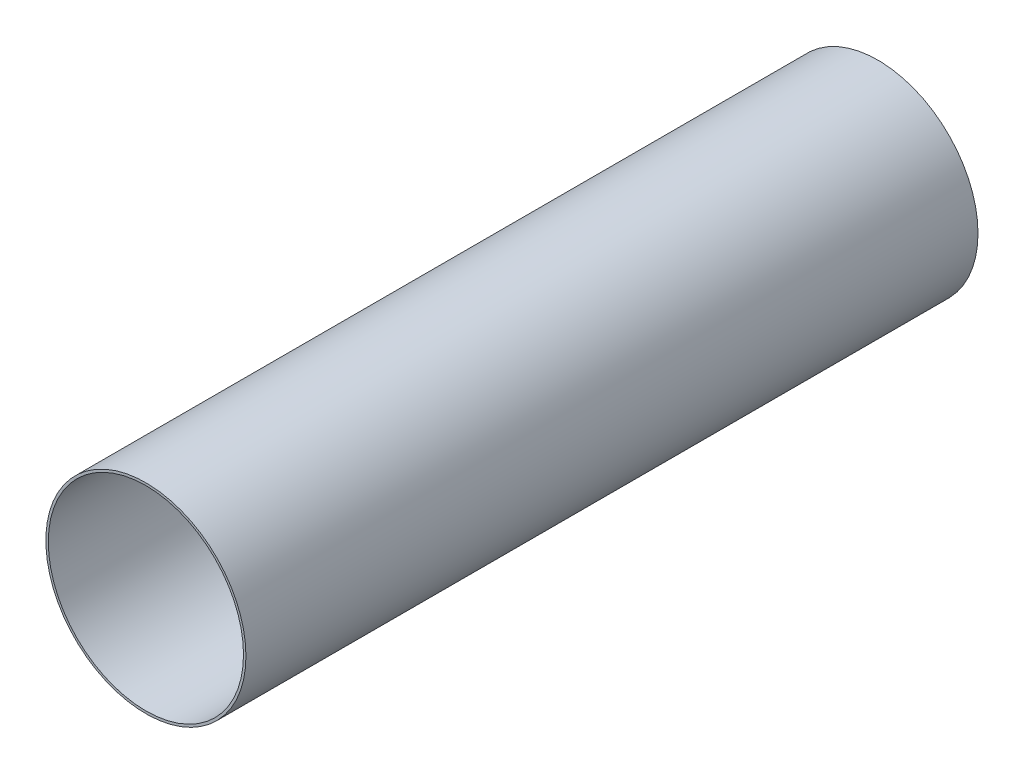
from build123d import *

# Parameters (mm, degrees)
SKETCH1_R           = 82
SKETCH1_R_2         = 80
BOSS_EXTRUDE1_DEPTH = 300


with BuildPart() as part:
    # Sketch1 → Boss-Extrude1 (new, symmetric)
    with BuildSketch(Plane.XY):
        Circle(SKETCH1_R)
        Circle(SKETCH1_R_2, mode=Mode.SUBTRACT)
    extrude(amount=BOSS_EXTRUDE1_DEPTH, both=True)


solid = part.part
